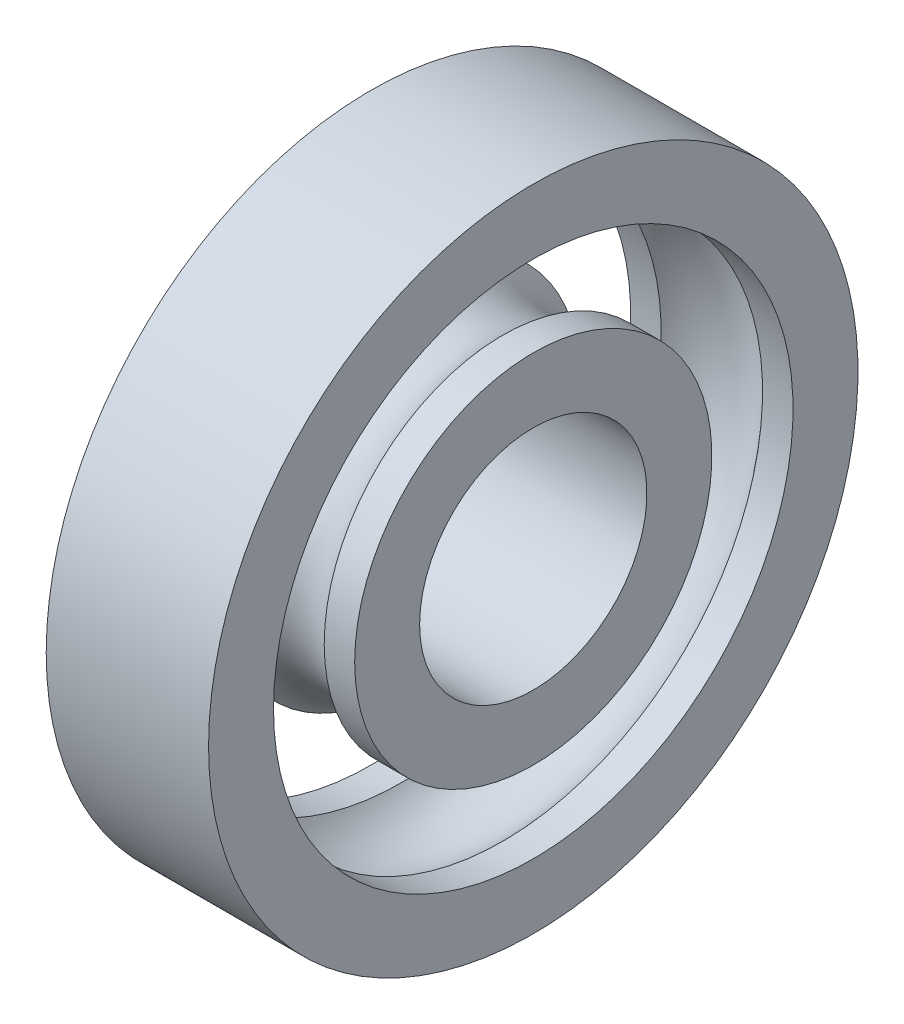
from build123d import *


with BuildPart() as part:
    # Sketch1 → Revolve1 (revolve)
    with BuildSketch(Plane.XY, mode=Mode.PRIVATE) as revolve1_sk:
        with BuildLine():
            Line((-3.122498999, 16), (-5, 16))
            Line((-5, 16), (-5, 20))
            Line((-5, 20), (5, 20))
            Line((5, 20), (5, 16))
            Line((5, 16), (3.122498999, 16))
            ThreePointArc((3.122498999, 16), (0, 17.5), (-3.122498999, 16))
        make_face()
        with BuildLine():
            Line((5, 7), (-5, 7))
            Line((-5, 7), (-5, 11))
            Line((-5, 11), (-3.122498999, 11))
            ThreePointArc((-3.122498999, 11), (0, 9.5), (3.122498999, 11))
            Line((3.122498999, 11), (5, 11))
            Line((5, 11), (5, 7))
        make_face()
    revolve(revolve1_sk.sketch.rotate(Axis((-5.539883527, 0, 0), (1, 0, 0)), 90), axis=Axis((-5.539883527, 0, 0), (1, 0, 0)))


solid = part.part
